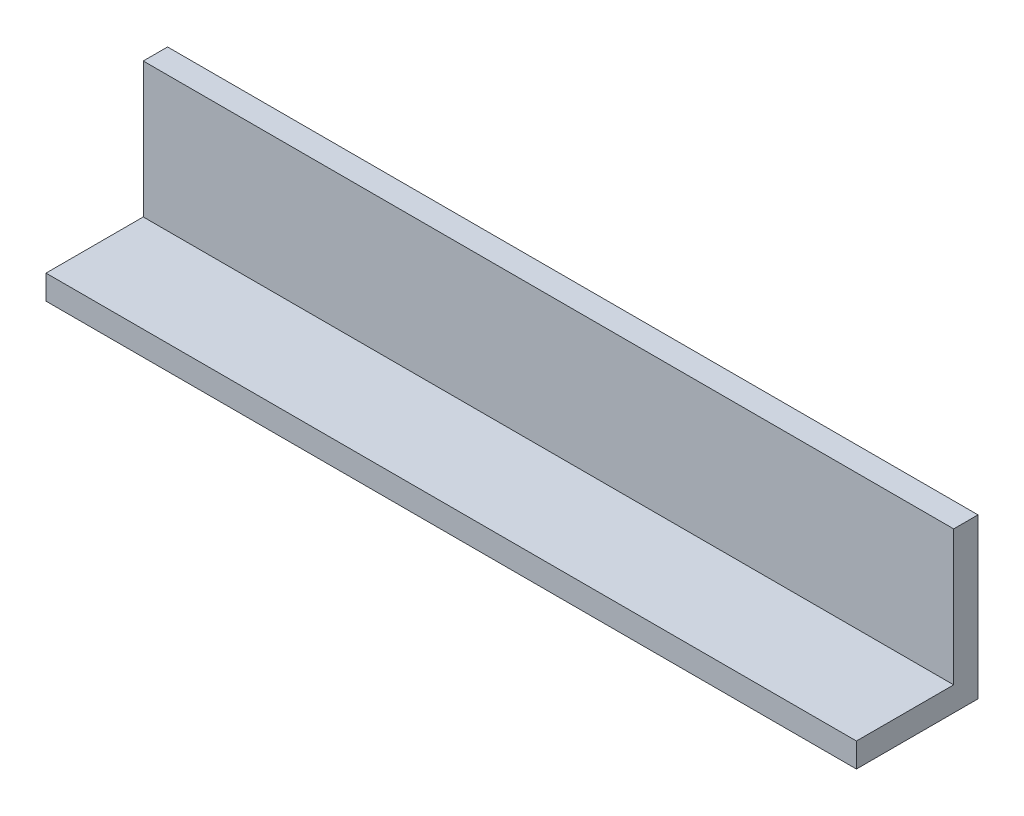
ISO-10303-21;
HEADER;
FILE_DESCRIPTION(('STEP AP214'),'2;1');
FILE_NAME('part.step','',(''),(''),'','','');
FILE_SCHEMA(('AUTOMOTIVE_DESIGN { 1 0 10303 214 1 1 1 1 }'));
ENDSEC;
DATA;
#1=APPLICATION_CONTEXT('core data for automotive mechanical design processes');
#2=APPLICATION_PROTOCOL_DEFINITION('international standard','automotive_design',2000,#1);
#3=PRODUCT_CONTEXT('',#1,'mechanical');
#4=PRODUCT('Part','Part','',(#3));
#5=PRODUCT_RELATED_PRODUCT_CATEGORY('part','',(#4));
#6=PRODUCT_DEFINITION_FORMATION('','',#4);
#7=PRODUCT_DEFINITION_CONTEXT('part definition',#1,'design');
#8=PRODUCT_DEFINITION('design','',#6,#7);
#9=PRODUCT_DEFINITION_SHAPE('','',#8);
#10=(LENGTH_UNIT() NAMED_UNIT(*) SI_UNIT(.MILLI.,.METRE.));
#11=(NAMED_UNIT(*) PLANE_ANGLE_UNIT() SI_UNIT($,.RADIAN.));
#12=(NAMED_UNIT(*) SI_UNIT($,.STERADIAN.) SOLID_ANGLE_UNIT());
#13=UNCERTAINTY_MEASURE_WITH_UNIT(LENGTH_MEASURE(1.E-05),#10,'distance_accuracy_value','');
#14=(GEOMETRIC_REPRESENTATION_CONTEXT(3) GLOBAL_UNCERTAINTY_ASSIGNED_CONTEXT((#13)) GLOBAL_UNIT_ASSIGNED_CONTEXT((#10,
#11,#12)) REPRESENTATION_CONTEXT('',''));
#15=CARTESIAN_POINT('',(0.,0.,0.));
#16=DIRECTION('',(0.,0.,1.));
#17=DIRECTION('',(1.,0.,0.));
#18=AXIS2_PLACEMENT_3D('',#15,#16,#17);
#19=CARTESIAN_POINT('',(-299.950280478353,0.,18.));
#20=DIRECTION('',(1.,0.,0.));
#21=DIRECTION('',(0.,0.,-1.));
#22=AXIS2_PLACEMENT_3D('',#19,#20,#21);
#23=PLANE('',#22);
#24=DIRECTION('',(0.,-1.,0.));
#25=VECTOR('',#24,1.);
#26=CARTESIAN_POINT('',(-299.950280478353,0.,0.));
#27=LINE('',#26,#25);
#28=CARTESIAN_POINT('',(-299.950280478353,0.,0.));
#29=VERTEX_POINT('',#28);
#30=CARTESIAN_POINT('',(-299.950280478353,-117.999999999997,0.));
#31=VERTEX_POINT('',#30);
#32=EDGE_CURVE('E98',#29,#31,#27,.T.);
#33=ORIENTED_EDGE('',*,*,#32,.T.);
#34=DIRECTION('',(0.,0.,1.));
#35=VECTOR('',#34,1.);
#36=CARTESIAN_POINT('',(-299.950280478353,-117.999999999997,0.));
#37=LINE('',#36,#35);
#38=CARTESIAN_POINT('',(-299.950280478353,-117.999999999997,90.0000000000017));
#39=VERTEX_POINT('',#38);
#40=EDGE_CURVE('E86',#31,#39,#37,.T.);
#41=ORIENTED_EDGE('',*,*,#40,.T.);
#42=DIRECTION('',(0.,1.,0.));
#43=VECTOR('',#42,1.);
#44=CARTESIAN_POINT('',(-299.950280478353,-117.999999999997,90.0000000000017));
#45=LINE('',#44,#43);
#46=CARTESIAN_POINT('',(-299.950280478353,-99.9999999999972,90.0000000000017));
#47=VERTEX_POINT('',#46);
#48=EDGE_CURVE('E117',#39,#47,#45,.T.);
#49=ORIENTED_EDGE('',*,*,#48,.T.);
#50=DIRECTION('',(0.,0.,1.));
#51=VECTOR('',#50,1.);
#52=CARTESIAN_POINT('',(-299.950280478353,-99.9999999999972,0.));
#53=LINE('',#52,#51);
#54=CARTESIAN_POINT('',(-299.950280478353,-99.9999999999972,18.));
#55=VERTEX_POINT('',#54);
#56=EDGE_CURVE('E126',#55,#47,#53,.T.);
#57=ORIENTED_EDGE('',*,*,#56,.F.);
#58=DIRECTION('',(0.,-1.,0.));
#59=VECTOR('',#58,1.);
#60=CARTESIAN_POINT('',(-299.950280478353,0.,18.));
#61=LINE('',#60,#59);
#62=CARTESIAN_POINT('',(-299.950280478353,0.,18.));
#63=VERTEX_POINT('',#62);
#64=EDGE_CURVE('E91',#63,#55,#61,.T.);
#65=ORIENTED_EDGE('',*,*,#64,.F.);
#66=DIRECTION('',(0.,0.,-1.));
#67=VECTOR('',#66,1.);
#68=CARTESIAN_POINT('',(-299.950280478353,0.,18.));
#69=LINE('',#68,#67);
#70=EDGE_CURVE('E41',#63,#29,#69,.T.);
#71=ORIENTED_EDGE('',*,*,#70,.T.);
#72=EDGE_LOOP('',(#33,#41,#49,#57,#65,#71));
#73=FACE_BOUND('',#72,.T.);
#74=ADVANCED_FACE('F33',(#73),#23,.F.);
#75=CARTESIAN_POINT('',(300.049719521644,0.,18.));
#76=DIRECTION('',(-1.,0.,0.));
#77=DIRECTION('',(0.,0.,1.));
#78=AXIS2_PLACEMENT_3D('',#75,#76,#77);
#79=PLANE('',#78);
#80=DIRECTION('',(0.,1.,0.));
#81=VECTOR('',#80,1.);
#82=CARTESIAN_POINT('',(300.049719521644,0.,0.));
#83=LINE('',#82,#81);
#84=CARTESIAN_POINT('',(300.049719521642,-117.999999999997,0.));
#85=VERTEX_POINT('',#84);
#86=CARTESIAN_POINT('',(300.049719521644,0.,0.));
#87=VERTEX_POINT('',#86);
#88=EDGE_CURVE('E61',#85,#87,#83,.T.);
#89=ORIENTED_EDGE('',*,*,#88,.T.);
#90=DIRECTION('',(0.,0.,-1.));
#91=VECTOR('',#90,1.);
#92=CARTESIAN_POINT('',(300.049719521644,0.,18.));
#93=LINE('',#92,#91);
#94=CARTESIAN_POINT('',(300.049719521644,0.,18.));
#95=VERTEX_POINT('',#94);
#96=EDGE_CURVE('E11',#95,#87,#93,.T.);
#97=ORIENTED_EDGE('',*,*,#96,.F.);
#98=DIRECTION('',(0.,1.,0.));
#99=VECTOR('',#98,1.);
#100=CARTESIAN_POINT('',(300.049719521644,0.,18.));
#101=LINE('',#100,#99);
#102=CARTESIAN_POINT('',(300.049719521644,-99.9999999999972,18.));
#103=VERTEX_POINT('',#102);
#104=EDGE_CURVE('E89',#103,#95,#101,.T.);
#105=ORIENTED_EDGE('',*,*,#104,.F.);
#106=DIRECTION('',(0.,0.,-1.));
#107=VECTOR('',#106,1.);
#108=CARTESIAN_POINT('',(300.049719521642,-99.9999999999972,0.));
#109=LINE('',#108,#107);
#110=CARTESIAN_POINT('',(300.049719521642,-99.9999999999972,90.0000000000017));
#111=VERTEX_POINT('',#110);
#112=EDGE_CURVE('E80',#111,#103,#109,.T.);
#113=ORIENTED_EDGE('',*,*,#112,.F.);
#114=DIRECTION('',(0.,1.,0.));
#115=VECTOR('',#114,1.);
#116=CARTESIAN_POINT('',(300.049719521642,-117.999999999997,90.0000000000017));
#117=LINE('',#116,#115);
#118=CARTESIAN_POINT('',(300.049719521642,-117.999999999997,90.0000000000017));
#119=VERTEX_POINT('',#118);
#120=EDGE_CURVE('E100',#119,#111,#117,.T.);
#121=ORIENTED_EDGE('',*,*,#120,.F.);
#122=DIRECTION('',(0.,0.,-1.));
#123=VECTOR('',#122,1.);
#124=CARTESIAN_POINT('',(300.049719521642,-117.999999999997,0.));
#125=LINE('',#124,#123);
#126=EDGE_CURVE('E118',#119,#85,#125,.T.);
#127=ORIENTED_EDGE('',*,*,#126,.T.);
#128=EDGE_LOOP('',(#89,#97,#105,#113,#121,#127));
#129=FACE_BOUND('',#128,.T.);
#130=ADVANCED_FACE('F93',(#129),#79,.F.);
#131=CARTESIAN_POINT('',(-299.950280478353,0.,18.));
#132=DIRECTION('',(0.,-1.,0.));
#133=DIRECTION('',(0.,0.,-1.));
#134=AXIS2_PLACEMENT_3D('',#131,#132,#133);
#135=PLANE('',#134);
#136=DIRECTION('',(-1.,0.,0.));
#137=VECTOR('',#136,1.);
#138=CARTESIAN_POINT('',(-299.950280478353,0.,0.));
#139=LINE('',#138,#137);
#140=EDGE_CURVE('E102',#87,#29,#139,.T.);
#141=ORIENTED_EDGE('',*,*,#140,.T.);
#142=ORIENTED_EDGE('',*,*,#70,.F.);
#143=DIRECTION('',(-1.,0.,0.));
#144=VECTOR('',#143,1.);
#145=CARTESIAN_POINT('',(-299.950280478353,0.,18.));
#146=LINE('',#145,#144);
#147=EDGE_CURVE('E49',#95,#63,#146,.T.);
#148=ORIENTED_EDGE('',*,*,#147,.F.);
#149=ORIENTED_EDGE('',*,*,#96,.T.);
#150=EDGE_LOOP('',(#141,#142,#148,#149));
#151=FACE_BOUND('',#150,.T.);
#152=ADVANCED_FACE('F154',(#151),#135,.F.);
#153=CARTESIAN_POINT('',(0.,0.,18.));
#154=DIRECTION('',(0.,0.,1.));
#155=DIRECTION('',(1.,0.,0.));
#156=AXIS2_PLACEMENT_3D('',#153,#154,#155);
#157=PLANE('',#156);
#158=ORIENTED_EDGE('',*,*,#64,.T.);
#159=DIRECTION('',(1.,0.,0.));
#160=VECTOR('',#159,1.);
#161=CARTESIAN_POINT('',(-299.950280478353,-99.9999999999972,18.));
#162=LINE('',#161,#160);
#163=EDGE_CURVE('E70',#55,#103,#162,.T.);
#164=ORIENTED_EDGE('',*,*,#163,.T.);
#165=ORIENTED_EDGE('',*,*,#104,.T.);
#166=ORIENTED_EDGE('',*,*,#147,.T.);
#167=EDGE_LOOP('',(#158,#164,#165,#166));
#168=FACE_BOUND('',#167,.T.);
#169=ADVANCED_FACE('F88',(#168),#157,.T.);
#170=CARTESIAN_POINT('',(0.,0.,0.));
#171=DIRECTION('',(0.,0.,1.));
#172=DIRECTION('',(1.,0.,0.));
#173=AXIS2_PLACEMENT_3D('',#170,#171,#172);
#174=PLANE('',#173);
#175=ORIENTED_EDGE('',*,*,#32,.F.);
#176=ORIENTED_EDGE('',*,*,#140,.F.);
#177=ORIENTED_EDGE('',*,*,#88,.F.);
#178=DIRECTION('',(-1.,0.,0.));
#179=VECTOR('',#178,1.);
#180=CARTESIAN_POINT('',(-299.950280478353,-117.999999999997,0.));
#181=LINE('',#180,#179);
#182=EDGE_CURVE('E114',#85,#31,#181,.T.);
#183=ORIENTED_EDGE('',*,*,#182,.T.);
#184=EDGE_LOOP('',(#175,#176,#177,#183));
#185=FACE_BOUND('',#184,.T.);
#186=ADVANCED_FACE('F112',(#185),#174,.F.);
#187=CARTESIAN_POINT('',(0.,-99.9999999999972,0.));
#188=DIRECTION('',(0.,1.,0.));
#189=DIRECTION('',(0.,0.,1.));
#190=AXIS2_PLACEMENT_3D('',#187,#188,#189);
#191=PLANE('',#190);
#192=ORIENTED_EDGE('',*,*,#163,.F.);
#193=ORIENTED_EDGE('',*,*,#56,.T.);
#194=DIRECTION('',(1.,0.,0.));
#195=VECTOR('',#194,1.);
#196=CARTESIAN_POINT('',(-299.950280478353,-99.9999999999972,90.0000000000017));
#197=LINE('',#196,#195);
#198=EDGE_CURVE('E83',#47,#111,#197,.T.);
#199=ORIENTED_EDGE('',*,*,#198,.T.);
#200=ORIENTED_EDGE('',*,*,#112,.T.);
#201=EDGE_LOOP('',(#192,#193,#199,#200));
#202=FACE_BOUND('',#201,.T.);
#203=ADVANCED_FACE('F81',(#202),#191,.T.);
#204=CARTESIAN_POINT('',(-299.950280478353,-117.999999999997,90.0000000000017));
#205=DIRECTION('',(0.,0.,1.));
#206=DIRECTION('',(1.,0.,0.));
#207=AXIS2_PLACEMENT_3D('',#204,#205,#206);
#208=PLANE('',#207);
#209=ORIENTED_EDGE('',*,*,#198,.F.);
#210=ORIENTED_EDGE('',*,*,#48,.F.);
#211=DIRECTION('',(1.,0.,0.));
#212=VECTOR('',#211,1.);
#213=CARTESIAN_POINT('',(-299.950280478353,-117.999999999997,90.0000000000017));
#214=LINE('',#213,#212);
#215=EDGE_CURVE('E122',#39,#119,#214,.T.);
#216=ORIENTED_EDGE('',*,*,#215,.T.);
#217=ORIENTED_EDGE('',*,*,#120,.T.);
#218=EDGE_LOOP('',(#209,#210,#216,#217));
#219=FACE_BOUND('',#218,.T.);
#220=ADVANCED_FACE('F132',(#219),#208,.T.);
#221=CARTESIAN_POINT('',(0.,-117.999999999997,0.));
#222=DIRECTION('',(0.,1.,0.));
#223=DIRECTION('',(0.,0.,1.));
#224=AXIS2_PLACEMENT_3D('',#221,#222,#223);
#225=PLANE('',#224);
#226=ORIENTED_EDGE('',*,*,#40,.F.);
#227=ORIENTED_EDGE('',*,*,#182,.F.);
#228=ORIENTED_EDGE('',*,*,#126,.F.);
#229=ORIENTED_EDGE('',*,*,#215,.F.);
#230=EDGE_LOOP('',(#226,#227,#228,#229));
#231=FACE_BOUND('',#230,.T.);
#232=ADVANCED_FACE('F139',(#231),#225,.F.);
#233=CLOSED_SHELL('',(#74,#130,#152,#169,#186,#203,#220,#232));
#234=MANIFOLD_SOLID_BREP('B2',#233);
#235=ADVANCED_BREP_SHAPE_REPRESENTATION('',(#18,#234),#14);
#236=SHAPE_DEFINITION_REPRESENTATION(#9,#235);
ENDSEC;
END-ISO-10303-21;
